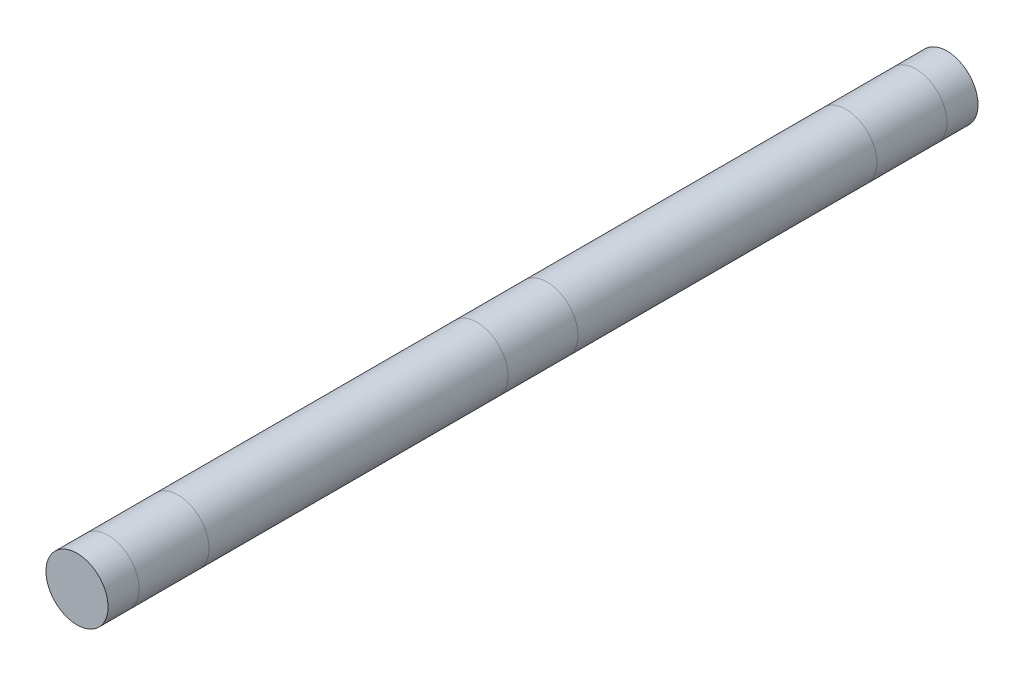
from build123d import *

# Parameters (mm, degrees)
SKETCH1_R      = 25.4
EXTRUDE1_DEPTH = 711.2


with BuildPart() as part:
    # Sketch1 → Extrude1 (new body)
    with BuildSketch(Plane.XY):
        Circle(SKETCH1_R)
    extrude(amount=EXTRUDE1_DEPTH)


solid = part.part
